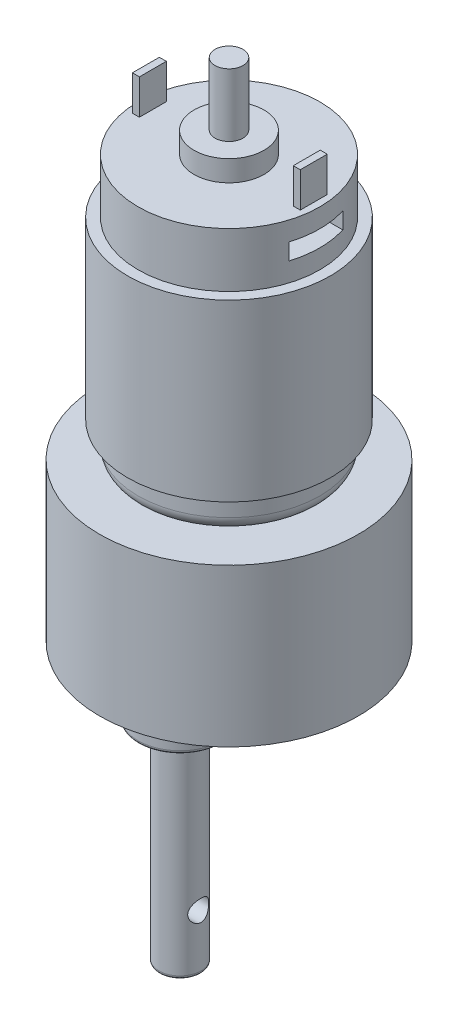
ISO-10303-21;
HEADER;
FILE_DESCRIPTION(('STEP AP214'),'2;1');
FILE_NAME('part.step','',(''),(''),'','','');
FILE_SCHEMA(('AUTOMOTIVE_DESIGN { 1 0 10303 214 1 1 1 1 }'));
ENDSEC;
DATA;
#1=APPLICATION_CONTEXT('core data for automotive mechanical design processes');
#2=APPLICATION_PROTOCOL_DEFINITION('international standard','automotive_design',2000,#1);
#3=PRODUCT_CONTEXT('',#1,'mechanical');
#4=PRODUCT('Part','Part','',(#3));
#5=PRODUCT_RELATED_PRODUCT_CATEGORY('part','',(#4));
#6=PRODUCT_DEFINITION_FORMATION('','',#4);
#7=PRODUCT_DEFINITION_CONTEXT('part definition',#1,'design');
#8=PRODUCT_DEFINITION('design','',#6,#7);
#9=PRODUCT_DEFINITION_SHAPE('','',#8);
#10=(LENGTH_UNIT() NAMED_UNIT(*) SI_UNIT(.MILLI.,.METRE.));
#11=(NAMED_UNIT(*) PLANE_ANGLE_UNIT() SI_UNIT($,.RADIAN.));
#12=(NAMED_UNIT(*) SI_UNIT($,.STERADIAN.) SOLID_ANGLE_UNIT());
#13=UNCERTAINTY_MEASURE_WITH_UNIT(LENGTH_MEASURE(1.E-05),#10,'distance_accuracy_value','');
#14=(GEOMETRIC_REPRESENTATION_CONTEXT(3) GLOBAL_UNCERTAINTY_ASSIGNED_CONTEXT((#13)) GLOBAL_UNIT_ASSIGNED_CONTEXT((#10,
#11,#12)) REPRESENTATION_CONTEXT('',''));
#15=CARTESIAN_POINT('',(0.,0.,0.));
#16=DIRECTION('',(0.,0.,1.));
#17=DIRECTION('',(1.,0.,0.));
#18=AXIS2_PLACEMENT_3D('',#15,#16,#17);
#19=CARTESIAN_POINT('',(-12.,65.3,-2.04396741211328));
#20=DIRECTION('',(0.,0.,1.));
#21=DIRECTION('',(1.,0.,0.));
#22=AXIS2_PLACEMENT_3D('',#19,#20,#21);
#23=PLANE('',#22);
#24=DIRECTION('',(-1.,0.,0.));
#25=VECTOR('',#24,1.);
#26=CARTESIAN_POINT('',(-12.,60.3,-2.04396741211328));
#27=LINE('',#26,#25);
#28=CARTESIAN_POINT('',(-11.,60.3,-2.04396741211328));
#29=VERTEX_POINT('',#28);
#30=CARTESIAN_POINT('',(-12.,60.3,-2.04396741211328));
#31=VERTEX_POINT('',#30);
#32=EDGE_CURVE('E120',#29,#31,#27,.T.);
#33=ORIENTED_EDGE('',*,*,#32,.T.);
#34=DIRECTION('',(0.,-1.,0.));
#35=VECTOR('',#34,1.);
#36=CARTESIAN_POINT('',(-12.,65.3,-2.04396741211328));
#37=LINE('',#36,#35);
#38=CARTESIAN_POINT('',(-12.,65.3,-2.04396741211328));
#39=VERTEX_POINT('',#38);
#40=EDGE_CURVE('E12',#39,#31,#37,.T.);
#41=ORIENTED_EDGE('',*,*,#40,.F.);
#42=DIRECTION('',(-1.,0.,0.));
#43=VECTOR('',#42,1.);
#44=CARTESIAN_POINT('',(-12.,65.3,-2.04396741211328));
#45=LINE('',#44,#43);
#46=CARTESIAN_POINT('',(-11.,65.3,-2.04396741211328));
#47=VERTEX_POINT('',#46);
#48=EDGE_CURVE('E108',#47,#39,#45,.T.);
#49=ORIENTED_EDGE('',*,*,#48,.F.);
#50=DIRECTION('',(0.,-1.,0.));
#51=VECTOR('',#50,1.);
#52=CARTESIAN_POINT('',(-11.,65.3,-2.04396741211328));
#53=LINE('',#52,#51);
#54=EDGE_CURVE('E116',#47,#29,#53,.T.);
#55=ORIENTED_EDGE('',*,*,#54,.T.);
#56=EDGE_LOOP('',(#33,#41,#49,#55));
#57=FACE_BOUND('',#56,.T.);
#58=ADVANCED_FACE('F57',(#57),#23,.F.);
#59=CARTESIAN_POINT('',(-12.,65.3,-2.04396741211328));
#60=DIRECTION('',(1.,0.,0.));
#61=DIRECTION('',(0.,0.,-1.));
#62=AXIS2_PLACEMENT_3D('',#59,#60,#61);
#63=PLANE('',#62);
#64=DIRECTION('',(0.,0.,1.));
#65=VECTOR('',#64,1.);
#66=CARTESIAN_POINT('',(-12.,60.3,-2.04396741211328));
#67=LINE('',#66,#65);
#68=CARTESIAN_POINT('',(-12.,60.3,1.81037113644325));
#69=VERTEX_POINT('',#68);
#70=EDGE_CURVE('E112',#31,#69,#67,.T.);
#71=ORIENTED_EDGE('',*,*,#70,.T.);
#72=DIRECTION('',(0.,-1.,0.));
#73=VECTOR('',#72,1.);
#74=CARTESIAN_POINT('',(-12.,65.3,1.81037113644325));
#75=LINE('',#74,#73);
#76=CARTESIAN_POINT('',(-12.,65.3,1.81037113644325));
#77=VERTEX_POINT('',#76);
#78=EDGE_CURVE('E65',#77,#69,#75,.T.);
#79=ORIENTED_EDGE('',*,*,#78,.F.);
#80=DIRECTION('',(0.,0.,1.));
#81=VECTOR('',#80,1.);
#82=CARTESIAN_POINT('',(-12.,65.3,-2.04396741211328));
#83=LINE('',#82,#81);
#84=EDGE_CURVE('E103',#39,#77,#83,.T.);
#85=ORIENTED_EDGE('',*,*,#84,.F.);
#86=ORIENTED_EDGE('',*,*,#40,.T.);
#87=EDGE_LOOP('',(#71,#79,#85,#86));
#88=FACE_BOUND('',#87,.T.);
#89=ADVANCED_FACE('F111',(#88),#63,.F.);
#90=CARTESIAN_POINT('',(-12.,65.3,1.81037113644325));
#91=DIRECTION('',(0.,0.,-1.));
#92=DIRECTION('',(-1.,0.,0.));
#93=AXIS2_PLACEMENT_3D('',#90,#91,#92);
#94=PLANE('',#93);
#95=DIRECTION('',(1.,0.,0.));
#96=VECTOR('',#95,1.);
#97=CARTESIAN_POINT('',(-12.,60.3,1.81037113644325));
#98=LINE('',#97,#96);
#99=CARTESIAN_POINT('',(-11.,60.3,1.81037113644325));
#100=VERTEX_POINT('',#99);
#101=EDGE_CURVE('E90',#69,#100,#98,.T.);
#102=ORIENTED_EDGE('',*,*,#101,.T.);
#103=DIRECTION('',(0.,-1.,0.));
#104=VECTOR('',#103,1.);
#105=CARTESIAN_POINT('',(-11.,65.3,1.81037113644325));
#106=LINE('',#105,#104);
#107=CARTESIAN_POINT('',(-11.,65.3,1.81037113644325));
#108=VERTEX_POINT('',#107);
#109=EDGE_CURVE('E113',#108,#100,#106,.T.);
#110=ORIENTED_EDGE('',*,*,#109,.F.);
#111=DIRECTION('',(1.,0.,0.));
#112=VECTOR('',#111,1.);
#113=CARTESIAN_POINT('',(-12.,65.3,1.81037113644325));
#114=LINE('',#113,#112);
#115=EDGE_CURVE('E106',#77,#108,#114,.T.);
#116=ORIENTED_EDGE('',*,*,#115,.F.);
#117=ORIENTED_EDGE('',*,*,#78,.T.);
#118=EDGE_LOOP('',(#102,#110,#116,#117));
#119=FACE_BOUND('',#118,.T.);
#120=ADVANCED_FACE('F114',(#119),#94,.F.);
#121=CARTESIAN_POINT('',(-11.,65.3,-2.04396741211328));
#122=DIRECTION('',(-1.,0.,0.));
#123=DIRECTION('',(0.,0.,1.));
#124=AXIS2_PLACEMENT_3D('',#121,#122,#123);
#125=PLANE('',#124);
#126=DIRECTION('',(0.,0.,-1.));
#127=VECTOR('',#126,1.);
#128=CARTESIAN_POINT('',(-11.,60.3,-2.04396741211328));
#129=LINE('',#128,#127);
#130=EDGE_CURVE('E96',#100,#29,#129,.T.);
#131=ORIENTED_EDGE('',*,*,#130,.T.);
#132=ORIENTED_EDGE('',*,*,#54,.F.);
#133=DIRECTION('',(0.,0.,-1.));
#134=VECTOR('',#133,1.);
#135=CARTESIAN_POINT('',(-11.,65.3,-2.04396741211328));
#136=LINE('',#135,#134);
#137=EDGE_CURVE('E73',#108,#47,#136,.T.);
#138=ORIENTED_EDGE('',*,*,#137,.F.);
#139=ORIENTED_EDGE('',*,*,#109,.T.);
#140=EDGE_LOOP('',(#131,#132,#138,#139));
#141=FACE_BOUND('',#140,.T.);
#142=ADVANCED_FACE('F127',(#141),#125,.F.);
#143=CARTESIAN_POINT('',(0.,65.3,0.));
#144=DIRECTION('',(0.,-1.,0.));
#145=DIRECTION('',(0.,0.,-1.));
#146=AXIS2_PLACEMENT_3D('',#143,#144,#145);
#147=PLANE('',#146);
#148=ORIENTED_EDGE('',*,*,#48,.T.);
#149=ORIENTED_EDGE('',*,*,#84,.T.);
#150=ORIENTED_EDGE('',*,*,#115,.T.);
#151=ORIENTED_EDGE('',*,*,#137,.T.);
#152=EDGE_LOOP('',(#148,#149,#150,#151));
#153=FACE_BOUND('',#152,.T.);
#154=ADVANCED_FACE('F104',(#153),#147,.F.);
#155=CARTESIAN_POINT('',(0.,60.3,0.));
#156=DIRECTION('',(0.,-1.,0.));
#157=DIRECTION('',(0.,0.,-1.));
#158=AXIS2_PLACEMENT_3D('',#155,#156,#157);
#159=PLANE('',#158);
#160=ORIENTED_EDGE('',*,*,#32,.F.);
#161=ORIENTED_EDGE('',*,*,#130,.F.);
#162=ORIENTED_EDGE('',*,*,#101,.F.);
#163=ORIENTED_EDGE('',*,*,#70,.F.);
#164=EDGE_LOOP('',(#160,#161,#162,#163));
#165=FACE_BOUND('',#164,.T.);
#166=ADVANCED_FACE('F130',(#165),#159,.T.);
#167=CLOSED_SHELL('',(#58,#89,#120,#142,#154,#166));
#168=MANIFOLD_SOLID_BREP('B2',#167);
#169=CARTESIAN_POINT('',(12.,65.3,-2.04396741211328));
#170=DIRECTION('',(-1.,0.,0.));
#171=DIRECTION('',(0.,0.,1.));
#172=AXIS2_PLACEMENT_3D('',#169,#170,#171);
#173=PLANE('',#172);
#174=DIRECTION('',(0.,0.,-1.));
#175=VECTOR('',#174,1.);
#176=CARTESIAN_POINT('',(12.,60.3,-2.04396741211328));
#177=LINE('',#176,#175);
#178=CARTESIAN_POINT('',(12.,60.3,1.81037113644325));
#179=VERTEX_POINT('',#178);
#180=CARTESIAN_POINT('',(12.,60.3,-2.04396741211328));
#181=VERTEX_POINT('',#180);
#182=EDGE_CURVE('E263',#179,#181,#177,.T.);
#183=ORIENTED_EDGE('',*,*,#182,.T.);
#184=DIRECTION('',(0.,-1.,0.));
#185=VECTOR('',#184,1.);
#186=CARTESIAN_POINT('',(12.,65.3,-2.04396741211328));
#187=LINE('',#186,#185);
#188=CARTESIAN_POINT('',(12.,65.3,-2.04396741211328));
#189=VERTEX_POINT('',#188);
#190=EDGE_CURVE('E55',#189,#181,#187,.T.);
#191=ORIENTED_EDGE('',*,*,#190,.F.);
#192=DIRECTION('',(0.,0.,-1.));
#193=VECTOR('',#192,1.);
#194=CARTESIAN_POINT('',(12.,65.3,-2.04396741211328));
#195=LINE('',#194,#193);
#196=CARTESIAN_POINT('',(12.,65.3,1.81037113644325));
#197=VERTEX_POINT('',#196);
#198=EDGE_CURVE('E251',#197,#189,#195,.T.);
#199=ORIENTED_EDGE('',*,*,#198,.F.);
#200=DIRECTION('',(0.,-1.,0.));
#201=VECTOR('',#200,1.);
#202=CARTESIAN_POINT('',(12.,65.3,1.81037113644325));
#203=LINE('',#202,#201);
#204=EDGE_CURVE('E259',#197,#179,#203,.T.);
#205=ORIENTED_EDGE('',*,*,#204,.T.);
#206=EDGE_LOOP('',(#183,#191,#199,#205));
#207=FACE_BOUND('',#206,.T.);
#208=ADVANCED_FACE('F200',(#207),#173,.F.);
#209=CARTESIAN_POINT('',(12.,65.3,-2.04396741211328));
#210=DIRECTION('',(0.,0.,1.));
#211=DIRECTION('',(1.,0.,0.));
#212=AXIS2_PLACEMENT_3D('',#209,#210,#211);
#213=PLANE('',#212);
#214=DIRECTION('',(-1.,0.,0.));
#215=VECTOR('',#214,1.);
#216=CARTESIAN_POINT('',(12.,60.3,-2.04396741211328));
#217=LINE('',#216,#215);
#218=CARTESIAN_POINT('',(11.,60.3,-2.04396741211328));
#219=VERTEX_POINT('',#218);
#220=EDGE_CURVE('E255',#181,#219,#217,.T.);
#221=ORIENTED_EDGE('',*,*,#220,.T.);
#222=DIRECTION('',(0.,-1.,0.));
#223=VECTOR('',#222,1.);
#224=CARTESIAN_POINT('',(11.,65.3,-2.04396741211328));
#225=LINE('',#224,#223);
#226=CARTESIAN_POINT('',(11.,65.3,-2.04396741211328));
#227=VERTEX_POINT('',#226);
#228=EDGE_CURVE('E208',#227,#219,#225,.T.);
#229=ORIENTED_EDGE('',*,*,#228,.F.);
#230=DIRECTION('',(-1.,0.,0.));
#231=VECTOR('',#230,1.);
#232=CARTESIAN_POINT('',(12.,65.3,-2.04396741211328));
#233=LINE('',#232,#231);
#234=EDGE_CURVE('E246',#189,#227,#233,.T.);
#235=ORIENTED_EDGE('',*,*,#234,.F.);
#236=ORIENTED_EDGE('',*,*,#190,.T.);
#237=EDGE_LOOP('',(#221,#229,#235,#236));
#238=FACE_BOUND('',#237,.T.);
#239=ADVANCED_FACE('F254',(#238),#213,.F.);
#240=CARTESIAN_POINT('',(11.,65.3,-2.04396741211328));
#241=DIRECTION('',(1.,0.,0.));
#242=DIRECTION('',(0.,0.,-1.));
#243=AXIS2_PLACEMENT_3D('',#240,#241,#242);
#244=PLANE('',#243);
#245=DIRECTION('',(0.,0.,1.));
#246=VECTOR('',#245,1.);
#247=CARTESIAN_POINT('',(11.,60.3,-2.04396741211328));
#248=LINE('',#247,#246);
#249=CARTESIAN_POINT('',(11.,60.3,1.81037113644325));
#250=VERTEX_POINT('',#249);
#251=EDGE_CURVE('E233',#219,#250,#248,.T.);
#252=ORIENTED_EDGE('',*,*,#251,.T.);
#253=DIRECTION('',(0.,-1.,0.));
#254=VECTOR('',#253,1.);
#255=CARTESIAN_POINT('',(11.,65.3,1.81037113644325));
#256=LINE('',#255,#254);
#257=CARTESIAN_POINT('',(11.,65.3,1.81037113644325));
#258=VERTEX_POINT('',#257);
#259=EDGE_CURVE('E256',#258,#250,#256,.T.);
#260=ORIENTED_EDGE('',*,*,#259,.F.);
#261=DIRECTION('',(0.,0.,1.));
#262=VECTOR('',#261,1.);
#263=CARTESIAN_POINT('',(11.,65.3,-2.04396741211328));
#264=LINE('',#263,#262);
#265=EDGE_CURVE('E249',#227,#258,#264,.T.);
#266=ORIENTED_EDGE('',*,*,#265,.F.);
#267=ORIENTED_EDGE('',*,*,#228,.T.);
#268=EDGE_LOOP('',(#252,#260,#266,#267));
#269=FACE_BOUND('',#268,.T.);
#270=ADVANCED_FACE('F257',(#269),#244,.F.);
#271=CARTESIAN_POINT('',(12.,65.3,1.81037113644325));
#272=DIRECTION('',(0.,0.,-1.));
#273=DIRECTION('',(-1.,0.,0.));
#274=AXIS2_PLACEMENT_3D('',#271,#272,#273);
#275=PLANE('',#274);
#276=DIRECTION('',(1.,0.,0.));
#277=VECTOR('',#276,1.);
#278=CARTESIAN_POINT('',(12.,60.3,1.81037113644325));
#279=LINE('',#278,#277);
#280=EDGE_CURVE('E239',#250,#179,#279,.T.);
#281=ORIENTED_EDGE('',*,*,#280,.T.);
#282=ORIENTED_EDGE('',*,*,#204,.F.);
#283=DIRECTION('',(1.,0.,0.));
#284=VECTOR('',#283,1.);
#285=CARTESIAN_POINT('',(12.,65.3,1.81037113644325));
#286=LINE('',#285,#284);
#287=EDGE_CURVE('E216',#258,#197,#286,.T.);
#288=ORIENTED_EDGE('',*,*,#287,.F.);
#289=ORIENTED_EDGE('',*,*,#259,.T.);
#290=EDGE_LOOP('',(#281,#282,#288,#289));
#291=FACE_BOUND('',#290,.T.);
#292=ADVANCED_FACE('F270',(#291),#275,.F.);
#293=CARTESIAN_POINT('',(0.,65.3,0.));
#294=DIRECTION('',(0.,-1.,0.));
#295=DIRECTION('',(0.,0.,-1.));
#296=AXIS2_PLACEMENT_3D('',#293,#294,#295);
#297=PLANE('',#296);
#298=ORIENTED_EDGE('',*,*,#198,.T.);
#299=ORIENTED_EDGE('',*,*,#234,.T.);
#300=ORIENTED_EDGE('',*,*,#265,.T.);
#301=ORIENTED_EDGE('',*,*,#287,.T.);
#302=EDGE_LOOP('',(#298,#299,#300,#301));
#303=FACE_BOUND('',#302,.T.);
#304=ADVANCED_FACE('F247',(#303),#297,.F.);
#305=CARTESIAN_POINT('',(0.,60.3,0.));
#306=DIRECTION('',(0.,-1.,0.));
#307=DIRECTION('',(0.,0.,-1.));
#308=AXIS2_PLACEMENT_3D('',#305,#306,#307);
#309=PLANE('',#308);
#310=ORIENTED_EDGE('',*,*,#182,.F.);
#311=ORIENTED_EDGE('',*,*,#280,.F.);
#312=ORIENTED_EDGE('',*,*,#251,.F.);
#313=ORIENTED_EDGE('',*,*,#220,.F.);
#314=EDGE_LOOP('',(#310,#311,#312,#313));
#315=FACE_BOUND('',#314,.T.);
#316=ADVANCED_FACE('F273',(#315),#309,.T.);
#317=CLOSED_SHELL('',(#208,#239,#270,#292,#304,#316));
#318=MANIFOLD_SOLID_BREP('B6',#317);
#319=CARTESIAN_POINT('',(0.,-36.3,7.));
#320=DIRECTION('',(0.,1.,0.));
#321=DIRECTION('',(0.,0.,1.));
#322=AXIS2_PLACEMENT_3D('',#319,#320,#321);
#323=CYLINDRICAL_SURFACE('',#322,3.);
#324=CARTESIAN_POINT('',(0.,-35.8,7.));
#325=DIRECTION('',(0.,-1.,0.));
#326=DIRECTION('',(0.,0.,-1.));
#327=AXIS2_PLACEMENT_3D('',#324,#325,#326);
#328=CIRCLE('',#327,3.);
#329=CARTESIAN_POINT('',(0.,-35.8,4.));
#330=VERTEX_POINT('',#329);
#331=EDGE_CURVE('E199',#330,#330,#328,.F.);
#332=ORIENTED_EDGE('',*,*,#331,.T.);
#333=EDGE_LOOP('',(#332));
#334=FACE_BOUND('',#333,.T.);
#335=CARTESIAN_POINT('',(0.,-6.3,7.));
#336=DIRECTION('',(0.,-1.,0.));
#337=DIRECTION('',(0.,0.,-1.));
#338=AXIS2_PLACEMENT_3D('',#335,#336,#337);
#339=CIRCLE('',#338,3.);
#340=CARTESIAN_POINT('',(0.,-6.3,4.));
#341=VERTEX_POINT('',#340);
#342=EDGE_CURVE('E362',#341,#341,#339,.T.);
#343=ORIENTED_EDGE('',*,*,#342,.T.);
#344=EDGE_LOOP('',(#343));
#345=FACE_BOUND('',#344,.T.);
#346=CARTESIAN_POINT('',(-2.59807621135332,-28.3,8.5));
#347=CARTESIAN_POINT('',(-2.59808302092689,-28.2218382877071,8.4999945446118));
#348=CARTESIAN_POINT('',(-2.60165701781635,-28.1435778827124,8.49384995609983));
#349=CARTESIAN_POINT('',(-2.61543549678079,-27.9894591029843,8.46958481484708));
#350=CARTESIAN_POINT('',(-2.62565391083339,-27.9136061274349,8.45143909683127));
#351=CARTESIAN_POINT('',(-2.65124019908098,-27.7668225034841,8.40414992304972));
#352=CARTESIAN_POINT('',(-2.66658065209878,-27.6958680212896,8.3750649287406));
#353=CARTESIAN_POINT('',(-2.70063997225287,-27.5598636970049,8.30690128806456));
#354=CARTESIAN_POINT('',(-2.71935902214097,-27.4948141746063,8.26782210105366));
#355=CARTESIAN_POINT('',(-2.75995303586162,-27.3665414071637,8.17699981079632));
#356=CARTESIAN_POINT('',(-2.7819609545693,-27.3039112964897,8.12447805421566));
#357=CARTESIAN_POINT('',(-2.82557974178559,-27.1878874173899,8.0098807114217));
#358=CARTESIAN_POINT('',(-2.84719040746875,-27.1344982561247,7.94780038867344));
#359=CARTESIAN_POINT('',(-2.88932215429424,-27.0349492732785,7.81073434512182));
#360=CARTESIAN_POINT('',(-2.90967159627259,-26.9895193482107,7.73516078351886));
#361=CARTESIAN_POINT('',(-2.94526134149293,-26.9122887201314,7.57623553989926));
#362=CARTESIAN_POINT('',(-2.96050486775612,-26.8804794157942,7.49288880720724));
#363=CARTESIAN_POINT('',(-2.98320691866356,-26.8337430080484,7.32706741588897));
#364=CARTESIAN_POINT('',(-2.99114220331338,-26.8177757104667,7.24495268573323));
#365=CARTESIAN_POINT('',(-3.000113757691,-26.7997508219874,7.07885594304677));
#366=CARTESIAN_POINT('',(-3.00115420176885,-26.7976848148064,6.99487509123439));
#367=CARTESIAN_POINT('',(-2.99644472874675,-26.8071200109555,6.83525121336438));
#368=CARTESIAN_POINT('',(-2.99127743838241,-26.8174570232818,6.75951820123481));
#369=CARTESIAN_POINT('',(-2.97561367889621,-26.849321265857,6.61102934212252));
#370=CARTESIAN_POINT('',(-2.96511681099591,-26.8708493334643,6.53827371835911));
#371=CARTESIAN_POINT('',(-2.93957374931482,-26.9246238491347,6.39653591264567));
#372=CARTESIAN_POINT('',(-2.92446662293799,-26.9570144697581,6.32761986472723));
#373=CARTESIAN_POINT('',(-2.89106468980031,-27.0313951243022,6.19603479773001));
#374=CARTESIAN_POINT('',(-2.87276874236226,-27.0733885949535,6.13336802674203));
#375=CARTESIAN_POINT('',(-2.83266591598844,-27.1703430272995,6.00973950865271));
#376=CARTESIAN_POINT('',(-2.81069063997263,-27.226154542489,5.94949888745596));
#377=CARTESIAN_POINT('',(-2.76681510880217,-27.3468845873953,5.83884344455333));
#378=CARTESIAN_POINT('',(-2.74491492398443,-27.4118100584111,5.78843618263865));
#379=CARTESIAN_POINT('',(-2.70216234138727,-27.5539722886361,5.69574199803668));
#380=CARTESIAN_POINT('',(-2.68146479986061,-27.6317290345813,5.65417402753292));
#381=CARTESIAN_POINT('',(-2.64563175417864,-27.7944065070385,5.58502133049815));
#382=CARTESIAN_POINT('',(-2.63049045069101,-27.8793196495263,5.55742201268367));
#383=CARTESIAN_POINT('',(-2.60916953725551,-28.0468217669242,5.51922968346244));
#384=CARTESIAN_POINT('',(-2.60237483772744,-28.1290616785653,5.50746231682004));
#385=CARTESIAN_POINT('',(-2.59676879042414,-28.2946020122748,5.49772458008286));
#386=CARTESIAN_POINT('',(-2.59795180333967,-28.3779016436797,5.49974446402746));
#387=CARTESIAN_POINT('',(-2.60751504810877,-28.5334808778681,5.51644593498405));
#388=CARTESIAN_POINT('',(-2.61509381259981,-28.6059691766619,5.5297182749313));
#389=CARTESIAN_POINT('',(-2.63541032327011,-28.7475516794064,5.56645557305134));
#390=CARTESIAN_POINT('',(-2.64814974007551,-28.8166447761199,5.58992383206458));
#391=CARTESIAN_POINT('',(-2.67804333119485,-28.953116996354,5.64752861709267));
#392=CARTESIAN_POINT('',(-2.69537464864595,-29.0202685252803,5.68210890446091));
#393=CARTESIAN_POINT('',(-2.73234179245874,-29.1482039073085,5.76056940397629));
#394=CARTESIAN_POINT('',(-2.75197880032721,-29.2089844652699,5.80445439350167));
#395=CARTESIAN_POINT('',(-2.79431997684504,-29.3304681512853,5.90674424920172));
#396=CARTESIAN_POINT('',(-2.81709874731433,-29.3901957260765,5.96628209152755));
#397=CARTESIAN_POINT('',(-2.86101352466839,-29.4991183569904,6.09489325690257));
#398=CARTESIAN_POINT('',(-2.88214897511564,-29.5483098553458,6.16396978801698));
#399=CARTESIAN_POINT('',(-2.92112042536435,-29.6358605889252,6.31219695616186));
#400=CARTESIAN_POINT('',(-2.93885462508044,-29.6738996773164,6.39156535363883));
#401=CARTESIAN_POINT('',(-2.96825032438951,-29.7357068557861,6.55671645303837));
#402=CARTESIAN_POINT('',(-2.97991715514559,-29.7594874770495,6.64249344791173));
#403=CARTESIAN_POINT('',(-2.99501262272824,-29.790052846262,6.80953047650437));
#404=CARTESIAN_POINT('',(-2.99909891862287,-29.7981968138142,6.89048283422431));
#405=CARTESIAN_POINT('',(-3.00063195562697,-29.8012648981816,7.0526889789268));
#406=CARTESIAN_POINT('',(-2.99808102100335,-29.7961936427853,7.13394265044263));
#407=CARTESIAN_POINT('',(-2.98700953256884,-29.7738753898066,7.28880698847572));
#408=CARTESIAN_POINT('',(-2.97889342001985,-29.7574527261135,7.36256847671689));
#409=CARTESIAN_POINT('',(-2.95788140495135,-29.7140095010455,7.50616892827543));
#410=CARTESIAN_POINT('',(-2.94498481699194,-29.6869874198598,7.57600732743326));
#411=CARTESIAN_POINT('',(-2.9148889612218,-29.621909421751,7.71313510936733));
#412=CARTESIAN_POINT('',(-2.89752925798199,-29.5834310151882,7.78018771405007));
#413=CARTESIAN_POINT('',(-2.86032199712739,-29.4970631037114,7.90716196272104));
#414=CARTESIAN_POINT('',(-2.84047329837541,-29.4491692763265,7.96708031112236));
#415=CARTESIAN_POINT('',(-2.79792915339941,-29.3398042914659,8.08437100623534));
#416=CARTESIAN_POINT('',(-2.77514698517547,-29.2774562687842,8.14089652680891));
#417=CARTESIAN_POINT('',(-2.73094614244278,-29.1438239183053,8.24299493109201));
#418=CARTESIAN_POINT('',(-2.70952868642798,-29.0725317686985,8.28855812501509));
#419=CARTESIAN_POINT('',(-2.66999407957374,-28.9200450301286,8.36864661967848));
#420=CARTESIAN_POINT('',(-2.65200261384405,-28.8386087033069,8.40277759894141));
#421=CARTESIAN_POINT('',(-2.62299234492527,-28.6700013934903,8.45631806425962));
#422=CARTESIAN_POINT('',(-2.61195024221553,-28.582850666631,8.47577678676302));
#423=CARTESIAN_POINT('',(-2.60293908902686,-28.462291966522,8.49155051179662));
#424=CARTESIAN_POINT('',(-2.60112193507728,-28.4299481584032,8.49471415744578));
#425=CARTESIAN_POINT('',(-2.59868903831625,-28.3650752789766,8.49894010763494));
#426=CARTESIAN_POINT('',(-2.59807337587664,-28.3325461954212,8.50000227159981));
#427=CARTESIAN_POINT('',(-2.59807621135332,-28.3,8.5));
#428=B_SPLINE_CURVE_WITH_KNOTS('',3,(#346,#347,#348,#349,#350,#351,#352,#353,#354,#355,#356,
#357,#358,#359,#360,#361,#362,#363,#364,#365,#366,#367,#368,#369,#370,#371,#372,#373,#374,#375,
#376,#377,#378,#379,#380,#381,#382,#383,#384,#385,#386,#387,#388,#389,#390,#391,#392,#393,#394,
#395,#396,#397,#398,#399,#400,#401,#402,#403,#404,#405,#406,#407,#408,#409,#410,#411,#412,#413,
#414,#415,#416,#417,#418,#419,#420,#421,#422,#423,#424,#425,#426,#427),.UNSPECIFIED.,.T.,.F.,(4,
2,2,2,2,2,2,2,2,2,2,2,2,2,2,2,2,2,2,2,2,2,2,2,2,2,2,2,2,2,2,2,2,2,2,2,2,2,2,2,4),(0.,
0.234348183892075,0.469189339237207,0.702792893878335,0.936409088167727,1.18929346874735,
1.44230356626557,1.71236838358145,1.98226240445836,2.23295227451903,2.4834903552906,
2.71224146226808,2.94100968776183,3.1729430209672,3.40495949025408,3.65890787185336,
3.91305072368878,4.18333262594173,4.45333161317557,4.70193436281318,4.9503613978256,
5.17161275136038,5.39293578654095,5.62450944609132,5.85620229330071,6.1171011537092,
6.37808797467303,6.64596272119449,6.91360169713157,7.15668405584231,7.39968130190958,
7.62666637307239,7.8536840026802,8.09041126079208,8.32724745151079,8.58765362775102,
8.84828914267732,9.11716123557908,9.38512699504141,9.48270202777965,9.58028358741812),.UNSPECIFIED.);
#429=CARTESIAN_POINT('',(-2.59807621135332,-28.3,8.5));
#430=VERTEX_POINT('',#429);
#431=EDGE_CURVE('E365',#430,#430,#428,.T.);
#432=ORIENTED_EDGE('',*,*,#431,.F.);
#433=EDGE_LOOP('',(#432));
#434=FACE_BOUND('',#433,.T.);
#435=CARTESIAN_POINT('',(2.59807621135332,-28.3,8.5));
#436=CARTESIAN_POINT('',(2.59808302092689,-28.3781617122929,8.4999945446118));
#437=CARTESIAN_POINT('',(2.60165701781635,-28.4564221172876,8.49384995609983));
#438=CARTESIAN_POINT('',(2.61543549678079,-28.6105408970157,8.46958481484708));
#439=CARTESIAN_POINT('',(2.62565391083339,-28.6863938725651,8.45143909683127));
#440=CARTESIAN_POINT('',(2.65124019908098,-28.8331774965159,8.40414992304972));
#441=CARTESIAN_POINT('',(2.66658065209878,-28.9041319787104,8.3750649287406));
#442=CARTESIAN_POINT('',(2.70063997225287,-29.0401363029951,8.30690128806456));
#443=CARTESIAN_POINT('',(2.71935902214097,-29.1051858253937,8.26782210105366));
#444=CARTESIAN_POINT('',(2.75995303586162,-29.2334585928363,8.17699981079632));
#445=CARTESIAN_POINT('',(2.7819609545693,-29.2960887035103,8.12447805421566));
#446=CARTESIAN_POINT('',(2.82557974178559,-29.4121125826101,8.0098807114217));
#447=CARTESIAN_POINT('',(2.84719040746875,-29.4655017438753,7.94780038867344));
#448=CARTESIAN_POINT('',(2.88932215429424,-29.5650507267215,7.81073434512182));
#449=CARTESIAN_POINT('',(2.90967159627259,-29.6104806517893,7.73516078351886));
#450=CARTESIAN_POINT('',(2.94526134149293,-29.6877112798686,7.57623553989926));
#451=CARTESIAN_POINT('',(2.96050486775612,-29.7195205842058,7.49288880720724));
#452=CARTESIAN_POINT('',(2.98320691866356,-29.7662569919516,7.32706741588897));
#453=CARTESIAN_POINT('',(2.99114220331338,-29.7822242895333,7.24495268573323));
#454=CARTESIAN_POINT('',(3.000113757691,-29.8002491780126,7.07885594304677));
#455=CARTESIAN_POINT('',(3.00115420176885,-29.8023151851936,6.99487509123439));
#456=CARTESIAN_POINT('',(2.99644472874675,-29.7928799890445,6.83525121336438));
#457=CARTESIAN_POINT('',(2.99127743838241,-29.7825429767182,6.75951820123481));
#458=CARTESIAN_POINT('',(2.97561367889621,-29.750678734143,6.61102934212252));
#459=CARTESIAN_POINT('',(2.96511681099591,-29.7291506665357,6.53827371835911));
#460=CARTESIAN_POINT('',(2.93957374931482,-29.6753761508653,6.39653591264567));
#461=CARTESIAN_POINT('',(2.92446662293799,-29.6429855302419,6.32761986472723));
#462=CARTESIAN_POINT('',(2.89106468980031,-29.5686048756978,6.19603479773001));
#463=CARTESIAN_POINT('',(2.87276874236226,-29.5266114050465,6.13336802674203));
#464=CARTESIAN_POINT('',(2.83266591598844,-29.4296569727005,6.00973950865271));
#465=CARTESIAN_POINT('',(2.81069063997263,-29.373845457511,5.94949888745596));
#466=CARTESIAN_POINT('',(2.76681510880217,-29.2531154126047,5.83884344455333));
#467=CARTESIAN_POINT('',(2.74491492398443,-29.1881899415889,5.78843618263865));
#468=CARTESIAN_POINT('',(2.70216234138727,-29.0460277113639,5.69574199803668));
#469=CARTESIAN_POINT('',(2.68146479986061,-28.9682709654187,5.65417402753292));
#470=CARTESIAN_POINT('',(2.64563175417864,-28.8055934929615,5.58502133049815));
#471=CARTESIAN_POINT('',(2.63049045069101,-28.7206803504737,5.55742201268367));
#472=CARTESIAN_POINT('',(2.60916953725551,-28.5531782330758,5.51922968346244));
#473=CARTESIAN_POINT('',(2.60237483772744,-28.4709383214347,5.50746231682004));
#474=CARTESIAN_POINT('',(2.59676879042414,-28.3053979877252,5.49772458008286));
#475=CARTESIAN_POINT('',(2.59795180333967,-28.2220983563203,5.49974446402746));
#476=CARTESIAN_POINT('',(2.60751504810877,-28.0665191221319,5.51644593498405));
#477=CARTESIAN_POINT('',(2.61509381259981,-27.9940308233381,5.5297182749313));
#478=CARTESIAN_POINT('',(2.63541032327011,-27.8524483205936,5.56645557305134));
#479=CARTESIAN_POINT('',(2.64814974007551,-27.7833552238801,5.58992383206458));
#480=CARTESIAN_POINT('',(2.67804333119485,-27.646883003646,5.64752861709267));
#481=CARTESIAN_POINT('',(2.69537464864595,-27.5797314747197,5.68210890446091));
#482=CARTESIAN_POINT('',(2.73234179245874,-27.4517960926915,5.76056940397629));
#483=CARTESIAN_POINT('',(2.75197880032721,-27.3910155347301,5.80445439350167));
#484=CARTESIAN_POINT('',(2.79431997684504,-27.2695318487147,5.90674424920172));
#485=CARTESIAN_POINT('',(2.81709874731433,-27.2098042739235,5.96628209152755));
#486=CARTESIAN_POINT('',(2.86101352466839,-27.1008816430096,6.09489325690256));
#487=CARTESIAN_POINT('',(2.88214897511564,-27.0516901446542,6.16396978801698));
#488=CARTESIAN_POINT('',(2.92112042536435,-26.9641394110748,6.31219695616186));
#489=CARTESIAN_POINT('',(2.93885462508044,-26.9261003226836,6.39156535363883));
#490=CARTESIAN_POINT('',(2.96825032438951,-26.8642931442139,6.55671645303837));
#491=CARTESIAN_POINT('',(2.97991715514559,-26.8405125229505,6.64249344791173));
#492=CARTESIAN_POINT('',(2.99501262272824,-26.809947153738,6.80953047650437));
#493=CARTESIAN_POINT('',(2.99909891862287,-26.8018031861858,6.89048283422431));
#494=CARTESIAN_POINT('',(3.00063195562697,-26.7987351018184,7.0526889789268));
#495=CARTESIAN_POINT('',(2.99808102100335,-26.8038063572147,7.13394265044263));
#496=CARTESIAN_POINT('',(2.98700953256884,-26.8261246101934,7.28880698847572));
#497=CARTESIAN_POINT('',(2.97889342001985,-26.8425472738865,7.36256847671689));
#498=CARTESIAN_POINT('',(2.95788140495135,-26.8859904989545,7.50616892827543));
#499=CARTESIAN_POINT('',(2.94498481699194,-26.9130125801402,7.57600732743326));
#500=CARTESIAN_POINT('',(2.9148889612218,-26.978090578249,7.71313510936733));
#501=CARTESIAN_POINT('',(2.89752925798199,-27.0165689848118,7.78018771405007));
#502=CARTESIAN_POINT('',(2.86032199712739,-27.1029368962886,7.90716196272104));
#503=CARTESIAN_POINT('',(2.84047329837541,-27.1508307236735,7.96708031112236));
#504=CARTESIAN_POINT('',(2.79792915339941,-27.2601957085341,8.08437100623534));
#505=CARTESIAN_POINT('',(2.77514698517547,-27.3225437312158,8.14089652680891));
#506=CARTESIAN_POINT('',(2.73094614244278,-27.4561760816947,8.24299493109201));
#507=CARTESIAN_POINT('',(2.70952868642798,-27.5274682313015,8.28855812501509));
#508=CARTESIAN_POINT('',(2.66999407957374,-27.6799549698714,8.36864661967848));
#509=CARTESIAN_POINT('',(2.65200261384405,-27.7613912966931,8.40277759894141));
#510=CARTESIAN_POINT('',(2.62299234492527,-27.9299986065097,8.45631806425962));
#511=CARTESIAN_POINT('',(2.61195024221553,-28.017149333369,8.47577678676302));
#512=CARTESIAN_POINT('',(2.60293908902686,-28.137708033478,8.49155051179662));
#513=CARTESIAN_POINT('',(2.60112193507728,-28.1700518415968,8.49471415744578));
#514=CARTESIAN_POINT('',(2.59868903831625,-28.2349247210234,8.49894010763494));
#515=CARTESIAN_POINT('',(2.59807337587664,-28.2674538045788,8.50000227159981));
#516=CARTESIAN_POINT('',(2.59807621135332,-28.3,8.5));
#517=B_SPLINE_CURVE_WITH_KNOTS('',3,(#435,#436,#437,#438,#439,#440,#441,#442,#443,#444,#445,
#446,#447,#448,#449,#450,#451,#452,#453,#454,#455,#456,#457,#458,#459,#460,#461,#462,#463,#464,
#465,#466,#467,#468,#469,#470,#471,#472,#473,#474,#475,#476,#477,#478,#479,#480,#481,#482,#483,
#484,#485,#486,#487,#488,#489,#490,#491,#492,#493,#494,#495,#496,#497,#498,#499,#500,#501,#502,
#503,#504,#505,#506,#507,#508,#509,#510,#511,#512,#513,#514,#515,#516),.UNSPECIFIED.,.T.,.F.,(4,
2,2,2,2,2,2,2,2,2,2,2,2,2,2,2,2,2,2,2,2,2,2,2,2,2,2,2,2,2,2,2,2,2,2,2,2,2,2,2,4),(0.,
0.234348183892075,0.469189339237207,0.702792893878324,0.936409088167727,1.18929346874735,
1.44230356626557,1.71236838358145,1.98226240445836,2.23295227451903,2.4834903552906,
2.71224146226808,2.94100968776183,3.1729430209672,3.40495949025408,3.65890787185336,
3.91305072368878,4.18333262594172,4.45333161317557,4.70193436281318,4.9503613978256,
5.17161275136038,5.39293578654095,5.62450944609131,5.85620229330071,6.1171011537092,
6.37808797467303,6.64596272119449,6.91360169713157,7.1566840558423,7.39968130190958,
7.62666637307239,7.8536840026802,8.09041126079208,8.32724745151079,8.58765362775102,
8.84828914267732,9.11716123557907,9.38512699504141,9.48270202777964,9.58028358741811),.UNSPECIFIED.);
#518=CARTESIAN_POINT('',(2.59807621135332,-28.3,8.5));
#519=VERTEX_POINT('',#518);
#520=EDGE_CURVE('E349',#519,#519,#517,.T.);
#521=ORIENTED_EDGE('',*,*,#520,.F.);
#522=EDGE_LOOP('',(#521));
#523=FACE_BOUND('',#522,.T.);
#524=ADVANCED_FACE('F345',(#334,#345,#434,#523),#323,.T.);
#525=CARTESIAN_POINT('',(0.,-36.3,7.));
#526=DIRECTION('',(0.,-1.,0.));
#527=DIRECTION('',(0.,0.,-1.));
#528=AXIS2_PLACEMENT_3D('',#525,#526,#527);
#529=PLANE('',#528);
#530=CARTESIAN_POINT('',(0.,-36.3,7.));
#531=DIRECTION('',(0.,-1.,0.));
#532=DIRECTION('',(0.,0.,-1.));
#533=AXIS2_PLACEMENT_3D('',#530,#531,#532);
#534=CIRCLE('',#533,2.5);
#535=CARTESIAN_POINT('',(0.,-36.3,4.5));
#536=VERTEX_POINT('',#535);
#537=EDGE_CURVE('E357',#536,#536,#534,.T.);
#538=ORIENTED_EDGE('',*,*,#537,.T.);
#539=EDGE_LOOP('',(#538));
#540=FACE_BOUND('',#539,.T.);
#541=ADVANCED_FACE('F377',(#540),#529,.T.);
#542=CARTESIAN_POINT('',(0.,-6.3,7.));
#543=DIRECTION('',(0.,-1.,0.));
#544=DIRECTION('',(0.,0.,-1.));
#545=AXIS2_PLACEMENT_3D('',#542,#543,#544);
#546=PLANE('',#545);
#547=ORIENTED_EDGE('',*,*,#342,.F.);
#548=EDGE_LOOP('',(#547));
#549=FACE_BOUND('',#548,.T.);
#550=ADVANCED_FACE('F380',(#549),#546,.F.);
#551=CARTESIAN_POINT('',(0.,-35.8,7.));
#552=DIRECTION('',(0.,-1.,0.));
#553=DIRECTION('',(0.,0.,-1.));
#554=AXIS2_PLACEMENT_3D('',#551,#552,#553);
#555=TOROIDAL_SURFACE('',#554,2.5,0.5);
#556=ORIENTED_EDGE('',*,*,#331,.F.);
#557=EDGE_LOOP('',(#556));
#558=FACE_BOUND('',#557,.T.);
#559=ORIENTED_EDGE('',*,*,#537,.F.);
#560=EDGE_LOOP('',(#559));
#561=FACE_BOUND('',#560,.T.);
#562=ADVANCED_FACE('F347',(#558,#561),#555,.T.);
#563=CARTESIAN_POINT('',(30.,-28.3,7.));
#564=DIRECTION('',(-1.,0.,0.));
#565=DIRECTION('',(0.,0.,1.));
#566=AXIS2_PLACEMENT_3D('',#563,#564,#565);
#567=CYLINDRICAL_SURFACE('',#566,1.5);
#568=ORIENTED_EDGE('',*,*,#431,.T.);
#569=EDGE_LOOP('',(#568));
#570=FACE_BOUND('',#569,.T.);
#571=ORIENTED_EDGE('',*,*,#520,.T.);
#572=EDGE_LOOP('',(#571));
#573=FACE_BOUND('',#572,.T.);
#574=ADVANCED_FACE('F372',(#570,#573),#567,.F.);
#575=CLOSED_SHELL('',(#524,#541,#550,#562,#574));
#576=MANIFOLD_SOLID_BREP('B49',#575);
#577=CARTESIAN_POINT('',(0.,60.3,0.));
#578=DIRECTION('',(0.,-1.,0.));
#579=DIRECTION('',(0.,0.,-1.));
#580=AXIS2_PLACEMENT_3D('',#577,#578,#579);
#581=CYLINDRICAL_SURFACE('',#580,13.);
#582=DIRECTION('',(0.,-1.,0.));
#583=VECTOR('',#582,1.);
#584=CARTESIAN_POINT('',(-12.4150154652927,60.3,-3.85582559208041));
#585=LINE('',#584,#583);
#586=CARTESIAN_POINT('',(-12.4150154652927,57.5781689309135,-3.85582559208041));
#587=VERTEX_POINT('',#586);
#588=CARTESIAN_POINT('',(-12.4150154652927,55.2218310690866,-3.85582559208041));
#589=VERTEX_POINT('',#588);
#590=EDGE_CURVE('E512',#587,#589,#585,.T.);
#591=ORIENTED_EDGE('',*,*,#590,.F.);
#592=CARTESIAN_POINT('',(0.,57.5781689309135,0.));
#593=DIRECTION('',(0.,-1.,0.));
#594=DIRECTION('',(0.,0.,-1.));
#595=AXIS2_PLACEMENT_3D('',#592,#593,#594);
#596=CIRCLE('',#595,13.);
#597=CARTESIAN_POINT('',(-12.4150154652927,57.5781689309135,3.85582559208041));
#598=VERTEX_POINT('',#597);
#599=EDGE_CURVE('E510',#598,#587,#596,.T.);
#600=ORIENTED_EDGE('',*,*,#599,.F.);
#601=DIRECTION('',(0.,-1.,0.));
#602=VECTOR('',#601,1.);
#603=CARTESIAN_POINT('',(-12.4150154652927,60.3,3.85582559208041));
#604=LINE('',#603,#602);
#605=CARTESIAN_POINT('',(-12.4150154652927,55.2218310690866,3.85582559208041));
#606=VERTEX_POINT('',#605);
#607=EDGE_CURVE('E495',#606,#598,#604,.F.);
#608=ORIENTED_EDGE('',*,*,#607,.F.);
#609=CARTESIAN_POINT('',(0.,55.2218310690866,0.));
#610=DIRECTION('',(0.,1.,0.));
#611=DIRECTION('',(0.,0.,1.));
#612=AXIS2_PLACEMENT_3D('',#609,#610,#611);
#613=CIRCLE('',#612,13.);
#614=EDGE_CURVE('E490',#589,#606,#613,.T.);
#615=ORIENTED_EDGE('',*,*,#614,.F.);
#616=EDGE_LOOP('',(#591,#600,#608,#615));
#617=FACE_BOUND('',#616,.T.);
#618=CARTESIAN_POINT('',(0.,52.5,0.));
#619=DIRECTION('',(0.,1.,0.));
#620=DIRECTION('',(0.,0.,1.));
#621=AXIS2_PLACEMENT_3D('',#618,#619,#620);
#622=CIRCLE('',#621,13.);
#623=CARTESIAN_POINT('',(0.,52.5,13.));
#624=VERTEX_POINT('',#623);
#625=EDGE_CURVE('E539',#624,#624,#622,.T.);
#626=ORIENTED_EDGE('',*,*,#625,.T.);
#627=EDGE_LOOP('',(#626));
#628=FACE_BOUND('',#627,.T.);
#629=CARTESIAN_POINT('',(0.,60.3,0.));
#630=DIRECTION('',(0.,1.,0.));
#631=DIRECTION('',(0.,0.,1.));
#632=AXIS2_PLACEMENT_3D('',#629,#630,#631);
#633=CIRCLE('',#632,13.);
#634=CARTESIAN_POINT('',(0.,60.3,13.));
#635=VERTEX_POINT('',#634);
#636=EDGE_CURVE('E542',#635,#635,#633,.T.);
#637=ORIENTED_EDGE('',*,*,#636,.F.);
#638=EDGE_LOOP('',(#637));
#639=FACE_BOUND('',#638,.T.);
#640=DIRECTION('',(0.,-1.,0.));
#641=VECTOR('',#640,1.);
#642=CARTESIAN_POINT('',(12.4150154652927,60.3,-3.85582559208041));
#643=LINE('',#642,#641);
#644=CARTESIAN_POINT('',(12.4150154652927,55.2218310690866,-3.85582559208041));
#645=VERTEX_POINT('',#644);
#646=CARTESIAN_POINT('',(12.4150154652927,57.5781689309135,-3.85582559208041));
#647=VERTEX_POINT('',#646);
#648=EDGE_CURVE('E454',#645,#647,#643,.F.);
#649=ORIENTED_EDGE('',*,*,#648,.F.);
#650=CARTESIAN_POINT('',(12.4150154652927,55.2218310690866,3.85582559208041));
#651=VERTEX_POINT('',#650);
#652=EDGE_CURVE('E498',#651,#645,#613,.T.);
#653=ORIENTED_EDGE('',*,*,#652,.F.);
#654=DIRECTION('',(0.,-1.,0.));
#655=VECTOR('',#654,1.);
#656=CARTESIAN_POINT('',(12.4150154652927,60.3,3.85582559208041));
#657=LINE('',#656,#655);
#658=CARTESIAN_POINT('',(12.4150154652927,57.5781689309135,3.85582559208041));
#659=VERTEX_POINT('',#658);
#660=EDGE_CURVE('E504',#659,#651,#657,.T.);
#661=ORIENTED_EDGE('',*,*,#660,.F.);
#662=EDGE_CURVE('E514',#647,#659,#596,.T.);
#663=ORIENTED_EDGE('',*,*,#662,.F.);
#664=EDGE_LOOP('',(#649,#653,#661,#663));
#665=FACE_BOUND('',#664,.T.);
#666=ADVANCED_FACE('F450',(#617,#628,#639,#665),#581,.T.);
#667=CARTESIAN_POINT('',(0.,60.3,0.));
#668=DIRECTION('',(0.,1.,0.));
#669=DIRECTION('',(0.,0.,1.));
#670=AXIS2_PLACEMENT_3D('',#667,#668,#669);
#671=PLANE('',#670);
#672=CARTESIAN_POINT('',(0.,60.3,0.));
#673=DIRECTION('',(0.,1.,0.));
#674=DIRECTION('',(0.,0.,1.));
#675=AXIS2_PLACEMENT_3D('',#672,#673,#674);
#676=CIRCLE('',#675,5.);
#677=CARTESIAN_POINT('',(0.,60.3,5.));
#678=VERTEX_POINT('',#677);
#679=EDGE_CURVE('E459',#678,#678,#676,.T.);
#680=ORIENTED_EDGE('',*,*,#679,.F.);
#681=EDGE_LOOP('',(#680));
#682=FACE_BOUND('',#681,.T.);
#683=ORIENTED_EDGE('',*,*,#636,.T.);
#684=EDGE_LOOP('',(#683));
#685=FACE_BOUND('',#684,.T.);
#686=ADVANCED_FACE('F575',(#682,#685),#671,.T.);
#687=CARTESIAN_POINT('',(0.,52.5,0.));
#688=DIRECTION('',(0.,-1.,0.));
#689=DIRECTION('',(0.,0.,-1.));
#690=AXIS2_PLACEMENT_3D('',#687,#688,#689);
#691=CYLINDRICAL_SURFACE('',#690,14.5);
#692=CARTESIAN_POINT('',(0.,52.5,0.));
#693=DIRECTION('',(0.,1.,0.));
#694=DIRECTION('',(0.,0.,1.));
#695=AXIS2_PLACEMENT_3D('',#692,#693,#694);
#696=CIRCLE('',#695,14.5);
#697=CARTESIAN_POINT('',(0.,52.5,14.5));
#698=VERTEX_POINT('',#697);
#699=EDGE_CURVE('E536',#698,#698,#696,.T.);
#700=ORIENTED_EDGE('',*,*,#699,.F.);
#701=EDGE_LOOP('',(#700));
#702=FACE_BOUND('',#701,.T.);
#703=CARTESIAN_POINT('',(0.,27.5,0.));
#704=DIRECTION('',(0.,1.,0.));
#705=DIRECTION('',(0.,0.,1.));
#706=AXIS2_PLACEMENT_3D('',#703,#704,#705);
#707=CIRCLE('',#706,14.5);
#708=CARTESIAN_POINT('',(0.,27.5,14.5));
#709=VERTEX_POINT('',#708);
#710=EDGE_CURVE('E535',#709,#709,#707,.T.);
#711=ORIENTED_EDGE('',*,*,#710,.T.);
#712=EDGE_LOOP('',(#711));
#713=FACE_BOUND('',#712,.T.);
#714=ADVANCED_FACE('F573',(#702,#713),#691,.T.);
#715=CARTESIAN_POINT('',(0.,52.5,0.));
#716=DIRECTION('',(0.,1.,0.));
#717=DIRECTION('',(0.,0.,1.));
#718=AXIS2_PLACEMENT_3D('',#715,#716,#717);
#719=PLANE('',#718);
#720=ORIENTED_EDGE('',*,*,#625,.F.);
#721=EDGE_LOOP('',(#720));
#722=FACE_BOUND('',#721,.T.);
#723=ORIENTED_EDGE('',*,*,#699,.T.);
#724=EDGE_LOOP('',(#723));
#725=FACE_BOUND('',#724,.T.);
#726=ADVANCED_FACE('F569',(#722,#725),#719,.T.);
#727=CARTESIAN_POINT('',(0.,27.5,0.));
#728=DIRECTION('',(0.,1.,0.));
#729=DIRECTION('',(0.,0.,1.));
#730=AXIS2_PLACEMENT_3D('',#727,#728,#729);
#731=PLANE('',#730);
#732=CARTESIAN_POINT('',(0.,27.5,0.));
#733=DIRECTION('',(0.,1.,0.));
#734=DIRECTION('',(0.,0.,1.));
#735=AXIS2_PLACEMENT_3D('',#732,#733,#734);
#736=CIRCLE('',#735,13.);
#737=CARTESIAN_POINT('',(0.,27.5,13.));
#738=VERTEX_POINT('',#737);
#739=EDGE_CURVE('E545',#738,#738,#736,.T.);
#740=ORIENTED_EDGE('',*,*,#739,.T.);
#741=EDGE_LOOP('',(#740));
#742=FACE_BOUND('',#741,.T.);
#743=ORIENTED_EDGE('',*,*,#710,.F.);
#744=EDGE_LOOP('',(#743));
#745=FACE_BOUND('',#744,.T.);
#746=ADVANCED_FACE('F566',(#742,#745),#731,.F.);
#747=CARTESIAN_POINT('',(0.,22.5,0.));
#748=DIRECTION('',(0.,1.,0.));
#749=DIRECTION('',(0.,0.,1.));
#750=AXIS2_PLACEMENT_3D('',#747,#748,#749);
#751=PLANE('',#750);
#752=CARTESIAN_POINT('',(0.,22.5,0.));
#753=DIRECTION('',(0.,1.,0.));
#754=DIRECTION('',(0.,0.,1.));
#755=AXIS2_PLACEMENT_3D('',#752,#753,#754);
#756=CIRCLE('',#755,11.);
#757=CARTESIAN_POINT('',(0.,22.5,11.));
#758=VERTEX_POINT('',#757);
#759=EDGE_CURVE('E496',#758,#758,#756,.F.);
#760=ORIENTED_EDGE('',*,*,#759,.T.);
#761=EDGE_LOOP('',(#760));
#762=FACE_BOUND('',#761,.T.);
#763=ADVANCED_FACE('F555',(#762),#751,.F.);
#764=CARTESIAN_POINT('',(0.,24.5,0.));
#765=DIRECTION('',(0.,1.,0.));
#766=DIRECTION('',(0.,0.,1.));
#767=AXIS2_PLACEMENT_3D('',#764,#765,#766);
#768=CIRCLE('',#767,13.);
#769=CARTESIAN_POINT('',(0.,24.5,13.));
#770=VERTEX_POINT('',#769);
#771=EDGE_CURVE('E548',#770,#770,#768,.T.);
#772=ORIENTED_EDGE('',*,*,#771,.T.);
#773=EDGE_LOOP('',(#772));
#774=FACE_BOUND('',#773,.T.);
#775=ORIENTED_EDGE('',*,*,#739,.F.);
#776=EDGE_LOOP('',(#775));
#777=FACE_BOUND('',#776,.T.);
#778=ADVANCED_FACE('F559',(#774,#777),#581,.T.);
#779=CARTESIAN_POINT('',(0.,24.5,0.));
#780=DIRECTION('',(0.,1.,0.));
#781=DIRECTION('',(0.,0.,1.));
#782=AXIS2_PLACEMENT_3D('',#779,#780,#781);
#783=TOROIDAL_SURFACE('',#782,11.,2.);
#784=ORIENTED_EDGE('',*,*,#759,.F.);
#785=EDGE_LOOP('',(#784));
#786=FACE_BOUND('',#785,.T.);
#787=ORIENTED_EDGE('',*,*,#771,.F.);
#788=EDGE_LOOP('',(#787));
#789=FACE_BOUND('',#788,.T.);
#790=ADVANCED_FACE('F452',(#786,#789),#783,.T.);
#791=CARTESIAN_POINT('',(30.,57.5781689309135,-3.85582559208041));
#792=DIRECTION('',(0.,0.,1.));
#793=DIRECTION('',(1.,0.,0.));
#794=AXIS2_PLACEMENT_3D('',#791,#792,#793);
#795=PLANE('',#794);
#796=ORIENTED_EDGE('',*,*,#590,.T.);
#797=DIRECTION('',(-1.,0.,0.));
#798=VECTOR('',#797,1.);
#799=CARTESIAN_POINT('',(30.,55.2218310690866,-3.85582559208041));
#800=LINE('',#799,#798);
#801=EDGE_CURVE('E472',#645,#589,#800,.T.);
#802=ORIENTED_EDGE('',*,*,#801,.F.);
#803=ORIENTED_EDGE('',*,*,#648,.T.);
#804=DIRECTION('',(-1.,0.,0.));
#805=VECTOR('',#804,1.);
#806=CARTESIAN_POINT('',(30.,57.5781689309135,-3.85582559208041));
#807=LINE('',#806,#805);
#808=EDGE_CURVE('E533',#647,#587,#807,.T.);
#809=ORIENTED_EDGE('',*,*,#808,.T.);
#810=EDGE_LOOP('',(#796,#802,#803,#809));
#811=FACE_BOUND('',#810,.T.);
#812=ADVANCED_FACE('F520',(#811),#795,.T.);
#813=CARTESIAN_POINT('',(30.,57.5781689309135,3.85582559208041));
#814=DIRECTION('',(0.,-1.,0.));
#815=DIRECTION('',(0.,0.,-1.));
#816=AXIS2_PLACEMENT_3D('',#813,#814,#815);
#817=PLANE('',#816);
#818=ORIENTED_EDGE('',*,*,#662,.T.);
#819=DIRECTION('',(-1.,0.,0.));
#820=VECTOR('',#819,1.);
#821=CARTESIAN_POINT('',(30.,57.5781689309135,3.85582559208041));
#822=LINE('',#821,#820);
#823=EDGE_CURVE('E506',#659,#598,#822,.T.);
#824=ORIENTED_EDGE('',*,*,#823,.T.);
#825=ORIENTED_EDGE('',*,*,#599,.T.);
#826=ORIENTED_EDGE('',*,*,#808,.F.);
#827=EDGE_LOOP('',(#818,#824,#825,#826));
#828=FACE_BOUND('',#827,.T.);
#829=ADVANCED_FACE('F610',(#828),#817,.T.);
#830=CARTESIAN_POINT('',(30.,57.5781689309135,3.85582559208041));
#831=DIRECTION('',(0.,0.,-1.));
#832=DIRECTION('',(0.,1.,0.));
#833=AXIS2_PLACEMENT_3D('',#830,#831,#832);
#834=PLANE('',#833);
#835=ORIENTED_EDGE('',*,*,#660,.T.);
#836=DIRECTION('',(-1.,0.,0.));
#837=VECTOR('',#836,1.);
#838=CARTESIAN_POINT('',(30.,55.2218310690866,3.85582559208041));
#839=LINE('',#838,#837);
#840=EDGE_CURVE('E467',#651,#606,#839,.T.);
#841=ORIENTED_EDGE('',*,*,#840,.T.);
#842=ORIENTED_EDGE('',*,*,#607,.T.);
#843=ORIENTED_EDGE('',*,*,#823,.F.);
#844=EDGE_LOOP('',(#835,#841,#842,#843));
#845=FACE_BOUND('',#844,.T.);
#846=ADVANCED_FACE('F500',(#845),#834,.T.);
#847=CARTESIAN_POINT('',(30.,55.2218310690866,3.85582559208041));
#848=DIRECTION('',(0.,1.,0.));
#849=DIRECTION('',(0.,0.,1.));
#850=AXIS2_PLACEMENT_3D('',#847,#848,#849);
#851=PLANE('',#850);
#852=ORIENTED_EDGE('',*,*,#652,.T.);
#853=ORIENTED_EDGE('',*,*,#801,.T.);
#854=ORIENTED_EDGE('',*,*,#614,.T.);
#855=ORIENTED_EDGE('',*,*,#840,.F.);
#856=EDGE_LOOP('',(#852,#853,#854,#855));
#857=FACE_BOUND('',#856,.T.);
#858=ADVANCED_FACE('F491',(#857),#851,.T.);
#859=CARTESIAN_POINT('',(0.,63.3,0.));
#860=DIRECTION('',(0.,-1.,0.));
#861=DIRECTION('',(0.,0.,-1.));
#862=AXIS2_PLACEMENT_3D('',#859,#860,#861);
#863=CYLINDRICAL_SURFACE('',#862,5.);
#864=CARTESIAN_POINT('',(0.,63.3,0.));
#865=DIRECTION('',(0.,1.,0.));
#866=DIRECTION('',(0.,0.,1.));
#867=AXIS2_PLACEMENT_3D('',#864,#865,#866);
#868=CIRCLE('',#867,5.);
#869=CARTESIAN_POINT('',(0.,63.3,5.));
#870=VERTEX_POINT('',#869);
#871=EDGE_CURVE('E523',#870,#870,#868,.T.);
#872=ORIENTED_EDGE('',*,*,#871,.F.);
#873=EDGE_LOOP('',(#872));
#874=FACE_BOUND('',#873,.T.);
#875=ORIENTED_EDGE('',*,*,#679,.T.);
#876=EDGE_LOOP('',(#875));
#877=FACE_BOUND('',#876,.T.);
#878=ADVANCED_FACE('F630',(#874,#877),#863,.T.);
#879=CARTESIAN_POINT('',(0.,63.3,0.));
#880=DIRECTION('',(0.,1.,0.));
#881=DIRECTION('',(0.,0.,1.));
#882=AXIS2_PLACEMENT_3D('',#879,#880,#881);
#883=PLANE('',#882);
#884=CARTESIAN_POINT('',(0.,63.3,0.));
#885=DIRECTION('',(0.,1.,0.));
#886=DIRECTION('',(0.,0.,1.));
#887=AXIS2_PLACEMENT_3D('',#884,#885,#886);
#888=CIRCLE('',#887,2.);
#889=CARTESIAN_POINT('',(0.,63.3,2.));
#890=VERTEX_POINT('',#889);
#891=EDGE_CURVE('E343',#890,#890,#888,.T.);
#892=ORIENTED_EDGE('',*,*,#891,.F.);
#893=EDGE_LOOP('',(#892));
#894=FACE_BOUND('',#893,.T.);
#895=ORIENTED_EDGE('',*,*,#871,.T.);
#896=EDGE_LOOP('',(#895));
#897=FACE_BOUND('',#896,.T.);
#898=ADVANCED_FACE('F637',(#894,#897),#883,.T.);
#899=CARTESIAN_POINT('',(0.,72.3,0.));
#900=DIRECTION('',(0.,-1.,0.));
#901=DIRECTION('',(0.,0.,-1.));
#902=AXIS2_PLACEMENT_3D('',#899,#900,#901);
#903=CYLINDRICAL_SURFACE('',#902,2.);
#904=CARTESIAN_POINT('',(0.,72.3,0.));
#905=DIRECTION('',(0.,1.,0.));
#906=DIRECTION('',(0.,0.,1.));
#907=AXIS2_PLACEMENT_3D('',#904,#905,#906);
#908=CIRCLE('',#907,2.);
#909=CARTESIAN_POINT('',(0.,72.3,2.));
#910=VERTEX_POINT('',#909);
#911=EDGE_CURVE('E744',#910,#910,#908,.T.);
#912=ORIENTED_EDGE('',*,*,#911,.F.);
#913=EDGE_LOOP('',(#912));
#914=FACE_BOUND('',#913,.T.);
#915=ORIENTED_EDGE('',*,*,#891,.T.);
#916=EDGE_LOOP('',(#915));
#917=FACE_BOUND('',#916,.T.);
#918=ADVANCED_FACE('F645',(#914,#917),#903,.T.);
#919=CARTESIAN_POINT('',(0.,72.3,0.));
#920=DIRECTION('',(0.,1.,0.));
#921=DIRECTION('',(0.,0.,1.));
#922=AXIS2_PLACEMENT_3D('',#919,#920,#921);
#923=PLANE('',#922);
#924=ORIENTED_EDGE('',*,*,#911,.T.);
#925=EDGE_LOOP('',(#924));
#926=FACE_BOUND('',#925,.T.);
#927=ADVANCED_FACE('F653',(#926),#923,.T.);
#928=CLOSED_SHELL('',(#666,#686,#714,#726,#746,#763,#778,#790,#812,#829,#846,#858,#878,#898,
#918,#927));
#929=MANIFOLD_SOLID_BREP('B194',#928);
#930=CARTESIAN_POINT('',(0.,22.5,0.));
#931=DIRECTION('',(0.,-1.,0.));
#932=DIRECTION('',(0.,0.,-1.));
#933=AXIS2_PLACEMENT_3D('',#930,#931,#932);
#934=CYLINDRICAL_SURFACE('',#933,18.5);
#935=CARTESIAN_POINT('',(0.,22.5,0.));
#936=DIRECTION('',(0.,1.,0.));
#937=DIRECTION('',(0.,0.,1.));
#938=AXIS2_PLACEMENT_3D('',#935,#936,#937);
#939=CIRCLE('',#938,18.5);
#940=CARTESIAN_POINT('',(0.,22.5,-18.5));
#941=VERTEX_POINT('',#940);
#942=EDGE_CURVE('E831',#941,#941,#939,.T.);
#943=CARTESIAN_POINT('',(0.,0.,0.));
#944=DIRECTION('',(0.,1.,0.));
#945=DIRECTION('',(0.,0.,1.));
#946=AXIS2_PLACEMENT_3D('',#943,#944,#945);
#947=CIRCLE('',#946,18.5);
#948=CARTESIAN_POINT('',(0.,0.,-18.5));
#949=VERTEX_POINT('',#948);
#950=EDGE_CURVE('E830',#949,#949,#947,.T.);
#951=CARTESIAN_POINT('',(0.,22.5,-18.5));
#952=CARTESIAN_POINT('',(0.,22.265625,-18.5));
#953=CARTESIAN_POINT('',(0.,22.03125,-18.5));
#954=CARTESIAN_POINT('',(0.,21.5625,-18.5));
#955=CARTESIAN_POINT('',(0.,21.328125,-18.5));
#956=CARTESIAN_POINT('',(0.,20.859375,-18.5));
#957=CARTESIAN_POINT('',(0.,20.625,-18.5));
#958=CARTESIAN_POINT('',(0.,20.15625,-18.5));
#959=CARTESIAN_POINT('',(0.,19.921875,-18.5));
#960=CARTESIAN_POINT('',(0.,19.453125,-18.5));
#961=CARTESIAN_POINT('',(0.,19.21875,-18.5));
#962=CARTESIAN_POINT('',(0.,18.75,-18.5));
#963=CARTESIAN_POINT('',(0.,18.515625,-18.5));
#964=CARTESIAN_POINT('',(0.,18.046875,-18.5));
#965=CARTESIAN_POINT('',(0.,17.8125,-18.5));
#966=CARTESIAN_POINT('',(0.,17.34375,-18.5));
#967=CARTESIAN_POINT('',(0.,17.109375,-18.5));
#968=CARTESIAN_POINT('',(0.,16.640625,-18.5));
#969=CARTESIAN_POINT('',(0.,16.40625,-18.5));
#970=CARTESIAN_POINT('',(0.,15.9375,-18.5));
#971=CARTESIAN_POINT('',(0.,15.703125,-18.5));
#972=CARTESIAN_POINT('',(0.,15.234375,-18.5));
#973=CARTESIAN_POINT('',(0.,15.,-18.5));
#974=CARTESIAN_POINT('',(0.,14.53125,-18.5));
#975=CARTESIAN_POINT('',(0.,14.296875,-18.5));
#976=CARTESIAN_POINT('',(0.,13.828125,-18.5));
#977=CARTESIAN_POINT('',(0.,13.59375,-18.5));
#978=CARTESIAN_POINT('',(0.,13.125,-18.5));
#979=CARTESIAN_POINT('',(0.,12.890625,-18.5));
#980=CARTESIAN_POINT('',(0.,12.421875,-18.5));
#981=CARTESIAN_POINT('',(0.,12.1875,-18.5));
#982=CARTESIAN_POINT('',(0.,11.71875,-18.5));
#983=CARTESIAN_POINT('',(0.,11.484375,-18.5));
#984=CARTESIAN_POINT('',(0.,11.015625,-18.5));
#985=CARTESIAN_POINT('',(0.,10.78125,-18.5));
#986=CARTESIAN_POINT('',(0.,10.3125,-18.5));
#987=CARTESIAN_POINT('',(0.,10.078125,-18.5));
#988=CARTESIAN_POINT('',(0.,9.60937499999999,-18.5));
#989=CARTESIAN_POINT('',(0.,9.375,-18.5));
#990=CARTESIAN_POINT('',(0.,8.90625,-18.5));
#991=CARTESIAN_POINT('',(0.,8.671875,-18.5));
#992=CARTESIAN_POINT('',(0.,8.20312499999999,-18.5));
#993=CARTESIAN_POINT('',(0.,7.96874999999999,-18.5));
#994=CARTESIAN_POINT('',(0.,7.5,-18.5));
#995=CARTESIAN_POINT('',(0.,7.265625,-18.5));
#996=CARTESIAN_POINT('',(0.,6.796875,-18.5));
#997=CARTESIAN_POINT('',(0.,6.5625,-18.5));
#998=CARTESIAN_POINT('',(0.,6.09375,-18.5));
#999=CARTESIAN_POINT('',(0.,5.859375,-18.5));
#1000=CARTESIAN_POINT('',(0.,5.390625,-18.5));
#1001=CARTESIAN_POINT('',(0.,5.15625,-18.5));
#1002=CARTESIAN_POINT('',(0.,4.6875,-18.5));
#1003=CARTESIAN_POINT('',(0.,4.453125,-18.5));
#1004=CARTESIAN_POINT('',(0.,3.984375,-18.5));
#1005=CARTESIAN_POINT('',(0.,3.75,-18.5));
#1006=CARTESIAN_POINT('',(0.,3.28125,-18.5));
#1007=CARTESIAN_POINT('',(0.,3.046875,-18.5));
#1008=CARTESIAN_POINT('',(0.,2.578125,-18.5));
#1009=CARTESIAN_POINT('',(0.,2.34375,-18.5));
#1010=CARTESIAN_POINT('',(0.,1.875,-18.5));
#1011=CARTESIAN_POINT('',(0.,1.640625,-18.5));
#1012=CARTESIAN_POINT('',(0.,1.171875,-18.5));
#1013=CARTESIAN_POINT('',(0.,0.937499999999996,-18.5));
#1014=CARTESIAN_POINT('',(0.,0.468749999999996,-18.5));
#1015=CARTESIAN_POINT('',(0.,0.234374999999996,-18.5));
#1016=CARTESIAN_POINT('',(0.,0.,-18.5));
#1017=B_SPLINE_CURVE_WITH_KNOTS('',3,(#951,#952,#953,#954,#955,#956,#957,#958,#959,#960,#961,
#962,#963,#964,#965,#966,#967,#968,#969,#970,#971,#972,#973,#974,#975,#976,#977,#978,#979,#980,
#981,#982,#983,#984,#985,#986,#987,#988,#989,#990,#991,#992,#993,#994,#995,#996,#997,#998,#999,
#1000,#1001,#1002,#1003,#1004,#1005,#1006,#1007,#1008,#1009,#1010,#1011,#1012,#1013,#1014,#1015,
#1016),.UNSPECIFIED.,.F.,.F.,(4,2,2,2,2,2,2,2,2,2,2,2,2,2,2,2,2,2,2,2,2,2,2,2,2,2,2,2,2,2,2,2,
4),(0.,0.703125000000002,1.40625,2.109375,2.8125,3.515625,4.21875,4.921875,5.625,6.328125,
7.03125,7.734375,8.4375,9.140625,9.84375,10.546875,11.25,11.953125,12.65625,13.359375,14.0625,
14.765625,15.46875,16.171875,16.875,17.578125,18.28125,18.984375,19.6875,20.390625,21.09375,
21.796875,22.5),.UNSPECIFIED.);
#1018=EDGE_CURVE('BSEAM758',#941,#949,#1017,.T.);
#1019=ORIENTED_EDGE('',*,*,#942,.F.);
#1020=ORIENTED_EDGE('',*,*,#950,.T.);
#1021=ORIENTED_EDGE('',*,*,#1018,.T.);
#1022=ORIENTED_EDGE('',*,*,#1018,.F.);
#1023=EDGE_LOOP('',(#1019,#1021,#1020,#1022));
#1024=FACE_BOUND('',#1023,.T.);
#1025=ADVANCED_FACE('F758',(#1024),#934,.T.);
#1026=CARTESIAN_POINT('',(0.,22.5,0.));
#1027=DIRECTION('',(0.,1.,0.));
#1028=DIRECTION('',(0.,0.,1.));
#1029=AXIS2_PLACEMENT_3D('',#1026,#1027,#1028);
#1030=PLANE('',#1029);
#1031=ORIENTED_EDGE('',*,*,#942,.T.);
#1032=EDGE_LOOP('',(#1031));
#1033=FACE_BOUND('',#1032,.T.);
#1034=ADVANCED_FACE('F856',(#1033),#1030,.T.);
#1035=CARTESIAN_POINT('',(0.,0.,0.));
#1036=DIRECTION('',(0.,1.,0.));
#1037=DIRECTION('',(0.,0.,1.));
#1038=AXIS2_PLACEMENT_3D('',#1035,#1036,#1037);
#1039=PLANE('',#1038);
#1040=CARTESIAN_POINT('',(-15.5,0.,0.));
#1041=DIRECTION('',(0.,-1.,0.));
#1042=DIRECTION('',(0.,0.,-1.));
#1043=AXIS2_PLACEMENT_3D('',#1040,#1041,#1042);
#1044=CIRCLE('',#1043,1.25);
#1045=CARTESIAN_POINT('',(-15.5,0.,-1.25));
#1046=VERTEX_POINT('',#1045);
#1047=EDGE_CURVE('E796',#1046,#1046,#1044,.T.);
#1048=ORIENTED_EDGE('',*,*,#1047,.F.);
#1049=EDGE_LOOP('',(#1048));
#1050=FACE_BOUND('',#1049,.T.);
#1051=CARTESIAN_POINT('',(-7.74999999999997,0.,13.4233937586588));
#1052=DIRECTION('',(0.,-1.,0.));
#1053=DIRECTION('',(0.,0.,-1.));
#1054=AXIS2_PLACEMENT_3D('',#1051,#1052,#1053);
#1055=CIRCLE('',#1054,1.25);
#1056=CARTESIAN_POINT('',(-7.74999999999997,0.,12.1733937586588));
#1057=VERTEX_POINT('',#1056);
#1058=EDGE_CURVE('E795',#1057,#1057,#1055,.T.);
#1059=ORIENTED_EDGE('',*,*,#1058,.F.);
#1060=EDGE_LOOP('',(#1059));
#1061=FACE_BOUND('',#1060,.T.);
#1062=CARTESIAN_POINT('',(7.75000000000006,0.,13.4233937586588));
#1063=DIRECTION('',(0.,-1.,0.));
#1064=DIRECTION('',(0.,0.,-1.));
#1065=AXIS2_PLACEMENT_3D('',#1062,#1063,#1064);
#1066=CIRCLE('',#1065,1.25);
#1067=CARTESIAN_POINT('',(7.75000000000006,0.,12.1733937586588));
#1068=VERTEX_POINT('',#1067);
#1069=EDGE_CURVE('E806',#1068,#1068,#1066,.T.);
#1070=ORIENTED_EDGE('',*,*,#1069,.F.);
#1071=EDGE_LOOP('',(#1070));
#1072=FACE_BOUND('',#1071,.T.);
#1073=CARTESIAN_POINT('',(15.5,0.,0.));
#1074=DIRECTION('',(0.,-1.,0.));
#1075=DIRECTION('',(0.,0.,-1.));
#1076=AXIS2_PLACEMENT_3D('',#1073,#1074,#1075);
#1077=CIRCLE('',#1076,1.25);
#1078=CARTESIAN_POINT('',(15.5,0.,-1.25));
#1079=VERTEX_POINT('',#1078);
#1080=EDGE_CURVE('E812',#1079,#1079,#1077,.T.);
#1081=ORIENTED_EDGE('',*,*,#1080,.F.);
#1082=EDGE_LOOP('',(#1081));
#1083=FACE_BOUND('',#1082,.T.);
#1084=CARTESIAN_POINT('',(7.74999999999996,0.,-13.4233937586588));
#1085=DIRECTION('',(0.,-1.,0.));
#1086=DIRECTION('',(0.,0.,-1.));
#1087=AXIS2_PLACEMENT_3D('',#1084,#1085,#1086);
#1088=CIRCLE('',#1087,1.25);
#1089=CARTESIAN_POINT('',(7.74999999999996,0.,-14.6733937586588));
#1090=VERTEX_POINT('',#1089);
#1091=EDGE_CURVE('E818',#1090,#1090,#1088,.T.);
#1092=ORIENTED_EDGE('',*,*,#1091,.F.);
#1093=EDGE_LOOP('',(#1092));
#1094=FACE_BOUND('',#1093,.T.);
#1095=CARTESIAN_POINT('',(-7.75000000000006,0.,-13.4233937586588));
#1096=DIRECTION('',(0.,-1.,0.));
#1097=DIRECTION('',(0.,0.,-1.));
#1098=AXIS2_PLACEMENT_3D('',#1095,#1096,#1097);
#1099=CIRCLE('',#1098,1.25);
#1100=CARTESIAN_POINT('',(-7.75000000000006,0.,-14.6733937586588));
#1101=VERTEX_POINT('',#1100);
#1102=EDGE_CURVE('E824',#1101,#1101,#1099,.T.);
#1103=ORIENTED_EDGE('',*,*,#1102,.F.);
#1104=EDGE_LOOP('',(#1103));
#1105=FACE_BOUND('',#1104,.T.);
#1106=CARTESIAN_POINT('',(0.,0.,7.));
#1107=DIRECTION('',(0.,1.,0.));
#1108=DIRECTION('',(0.,0.,1.));
#1109=AXIS2_PLACEMENT_3D('',#1106,#1107,#1108);
#1110=CIRCLE('',#1109,6.);
#1111=CARTESIAN_POINT('',(0.,0.,13.));
#1112=VERTEX_POINT('',#1111);
#1113=EDGE_CURVE('E834',#1112,#1112,#1110,.F.);
#1114=ORIENTED_EDGE('',*,*,#1113,.F.);
#1115=EDGE_LOOP('',(#1114));
#1116=FACE_BOUND('',#1115,.T.);
#1117=ORIENTED_EDGE('',*,*,#950,.F.);
#1118=EDGE_LOOP('',(#1117));
#1119=FACE_BOUND('',#1118,.T.);
#1120=ADVANCED_FACE('F861',(#1050,#1061,#1072,#1083,#1094,#1105,#1116,#1119),#1039,.F.);
#1121=CARTESIAN_POINT('',(0.,-6.3,7.));
#1122=DIRECTION('',(0.,1.,0.));
#1123=DIRECTION('',(0.,0.,1.));
#1124=AXIS2_PLACEMENT_3D('',#1121,#1122,#1123);
#1125=CYLINDRICAL_SURFACE('',#1124,6.);
#1126=CARTESIAN_POINT('',(0.,-5.8,7.));
#1127=DIRECTION('',(0.,-1.,0.));
#1128=DIRECTION('',(0.,0.,-1.));
#1129=AXIS2_PLACEMENT_3D('',#1126,#1127,#1128);
#1130=CIRCLE('',#1129,6.);
#1131=CARTESIAN_POINT('',(0.,-5.8,0.999999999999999));
#1132=VERTEX_POINT('',#1131);
#1133=EDGE_CURVE('E448',#1132,#1132,#1130,.F.);
#1134=ORIENTED_EDGE('',*,*,#1133,.T.);
#1135=EDGE_LOOP('',(#1134));
#1136=FACE_BOUND('',#1135,.T.);
#1137=ORIENTED_EDGE('',*,*,#1113,.T.);
#1138=EDGE_LOOP('',(#1137));
#1139=FACE_BOUND('',#1138,.T.);
#1140=ADVANCED_FACE('F852',(#1136,#1139),#1125,.T.);
#1141=CARTESIAN_POINT('',(0.,-6.3,7.));
#1142=DIRECTION('',(0.,-1.,0.));
#1143=DIRECTION('',(0.,0.,-1.));
#1144=AXIS2_PLACEMENT_3D('',#1141,#1142,#1143);
#1145=PLANE('',#1144);
#1146=CARTESIAN_POINT('',(0.,-6.3,7.));
#1147=DIRECTION('',(0.,-1.,0.));
#1148=DIRECTION('',(0.,0.,-1.));
#1149=AXIS2_PLACEMENT_3D('',#1146,#1147,#1148);
#1150=CIRCLE('',#1149,5.5);
#1151=CARTESIAN_POINT('',(0.,-6.3,1.5));
#1152=VERTEX_POINT('',#1151);
#1153=EDGE_CURVE('E766',#1152,#1152,#1150,.T.);
#1154=ORIENTED_EDGE('',*,*,#1153,.T.);
#1155=EDGE_LOOP('',(#1154));
#1156=FACE_BOUND('',#1155,.T.);
#1157=ADVANCED_FACE('F841',(#1156),#1145,.T.);
#1158=CARTESIAN_POINT('',(0.,-5.8,7.));
#1159=DIRECTION('',(0.,-1.,0.));
#1160=DIRECTION('',(0.,0.,-1.));
#1161=AXIS2_PLACEMENT_3D('',#1158,#1159,#1160);
#1162=TOROIDAL_SURFACE('',#1161,5.5,0.5);
#1163=ORIENTED_EDGE('',*,*,#1133,.F.);
#1164=EDGE_LOOP('',(#1163));
#1165=FACE_BOUND('',#1164,.T.);
#1166=ORIENTED_EDGE('',*,*,#1153,.F.);
#1167=EDGE_LOOP('',(#1166));
#1168=FACE_BOUND('',#1167,.T.);
#1169=ADVANCED_FACE('F760',(#1165,#1168),#1162,.T.);
#1170=CARTESIAN_POINT('',(-7.75000000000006,3.5,-13.4233937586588));
#1171=DIRECTION('',(0.,-1.,0.));
#1172=DIRECTION('',(0.,0.,-1.));
#1173=AXIS2_PLACEMENT_3D('',#1170,#1171,#1172);
#1174=CONICAL_SURFACE('',#1173,1.25,1.02974425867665);
#1175=CARTESIAN_POINT('',(-7.75000000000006,4.25107577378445,-13.4233937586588));
#1176=VERTEX_POINT('',#1175);
#1177=VERTEX_LOOP('',#1176);
#1178=FACE_BOUND('',#1177,.T.);
#1179=CARTESIAN_POINT('',(-7.75000000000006,3.5,-13.4233937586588));
#1180=DIRECTION('',(0.,-1.,0.));
#1181=DIRECTION('',(0.,0.,-1.));
#1182=AXIS2_PLACEMENT_3D('',#1179,#1180,#1181);
#1183=CIRCLE('',#1182,1.25);
#1184=CARTESIAN_POINT('',(-7.75000000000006,3.5,-14.6733937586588));
#1185=VERTEX_POINT('',#1184);
#1186=EDGE_CURVE('E827',#1185,#1185,#1183,.T.);
#1187=ORIENTED_EDGE('',*,*,#1186,.T.);
#1188=EDGE_LOOP('',(#1187));
#1189=FACE_BOUND('',#1188,.T.);
#1190=ADVANCED_FACE('F844',(#1178,#1189),#1174,.F.);
#1191=CARTESIAN_POINT('',(-7.75000000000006,0.,-13.4233937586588));
#1192=DIRECTION('',(0.,-1.,0.));
#1193=DIRECTION('',(0.,0.,-1.));
#1194=AXIS2_PLACEMENT_3D('',#1191,#1192,#1193);
#1195=CYLINDRICAL_SURFACE('',#1194,1.25);
#1196=ORIENTED_EDGE('',*,*,#1186,.F.);
#1197=EDGE_LOOP('',(#1196));
#1198=FACE_BOUND('',#1197,.T.);
#1199=ORIENTED_EDGE('',*,*,#1102,.T.);
#1200=EDGE_LOOP('',(#1199));
#1201=FACE_BOUND('',#1200,.T.);
#1202=ADVANCED_FACE('F850',(#1198,#1201),#1195,.F.);
#1203=CARTESIAN_POINT('',(7.74999999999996,3.5,-13.4233937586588));
#1204=DIRECTION('',(0.,-1.,0.));
#1205=DIRECTION('',(0.,0.,-1.));
#1206=AXIS2_PLACEMENT_3D('',#1203,#1204,#1205);
#1207=CONICAL_SURFACE('',#1206,1.25,1.02974425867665);
#1208=CARTESIAN_POINT('',(7.74999999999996,4.25107577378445,-13.4233937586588));
#1209=VERTEX_POINT('',#1208);
#1210=VERTEX_LOOP('',#1209);
#1211=FACE_BOUND('',#1210,.T.);
#1212=CARTESIAN_POINT('',(7.74999999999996,3.5,-13.4233937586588));
#1213=DIRECTION('',(0.,-1.,0.));
#1214=DIRECTION('',(0.,0.,-1.));
#1215=AXIS2_PLACEMENT_3D('',#1212,#1213,#1214);
#1216=CIRCLE('',#1215,1.25);
#1217=CARTESIAN_POINT('',(7.74999999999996,3.5,-14.6733937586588));
#1218=VERTEX_POINT('',#1217);
#1219=EDGE_CURVE('E821',#1218,#1218,#1216,.T.);
#1220=ORIENTED_EDGE('',*,*,#1219,.T.);
#1221=EDGE_LOOP('',(#1220));
#1222=FACE_BOUND('',#1221,.T.);
#1223=ADVANCED_FACE('F875',(#1211,#1222),#1207,.F.);
#1224=CARTESIAN_POINT('',(7.74999999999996,0.,-13.4233937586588));
#1225=DIRECTION('',(0.,-1.,0.));
#1226=DIRECTION('',(0.,0.,-1.));
#1227=AXIS2_PLACEMENT_3D('',#1224,#1225,#1226);
#1228=CYLINDRICAL_SURFACE('',#1227,1.25);
#1229=ORIENTED_EDGE('',*,*,#1219,.F.);
#1230=EDGE_LOOP('',(#1229));
#1231=FACE_BOUND('',#1230,.T.);
#1232=ORIENTED_EDGE('',*,*,#1091,.T.);
#1233=EDGE_LOOP('',(#1232));
#1234=FACE_BOUND('',#1233,.T.);
#1235=ADVANCED_FACE('F879',(#1231,#1234),#1228,.F.);
#1236=CARTESIAN_POINT('',(15.5,3.5,0.));
#1237=DIRECTION('',(0.,-1.,0.));
#1238=DIRECTION('',(0.,0.,-1.));
#1239=AXIS2_PLACEMENT_3D('',#1236,#1237,#1238);
#1240=CONICAL_SURFACE('',#1239,1.25,1.02974425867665);
#1241=CARTESIAN_POINT('',(15.5,4.25107577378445,0.));
#1242=VERTEX_POINT('',#1241);
#1243=VERTEX_LOOP('',#1242);
#1244=FACE_BOUND('',#1243,.T.);
#1245=CARTESIAN_POINT('',(15.5,3.5,0.));
#1246=DIRECTION('',(0.,-1.,0.));
#1247=DIRECTION('',(0.,0.,-1.));
#1248=AXIS2_PLACEMENT_3D('',#1245,#1246,#1247);
#1249=CIRCLE('',#1248,1.25);
#1250=CARTESIAN_POINT('',(15.5,3.5,-1.25));
#1251=VERTEX_POINT('',#1250);
#1252=EDGE_CURVE('E815',#1251,#1251,#1249,.T.);
#1253=ORIENTED_EDGE('',*,*,#1252,.T.);
#1254=EDGE_LOOP('',(#1253));
#1255=FACE_BOUND('',#1254,.T.);
#1256=ADVANCED_FACE('F882',(#1244,#1255),#1240,.F.);
#1257=CARTESIAN_POINT('',(15.5,0.,0.));
#1258=DIRECTION('',(0.,-1.,0.));
#1259=DIRECTION('',(0.,0.,-1.));
#1260=AXIS2_PLACEMENT_3D('',#1257,#1258,#1259);
#1261=CYLINDRICAL_SURFACE('',#1260,1.25);
#1262=ORIENTED_EDGE('',*,*,#1252,.F.);
#1263=EDGE_LOOP('',(#1262));
#1264=FACE_BOUND('',#1263,.T.);
#1265=ORIENTED_EDGE('',*,*,#1080,.T.);
#1266=EDGE_LOOP('',(#1265));
#1267=FACE_BOUND('',#1266,.T.);
#1268=ADVANCED_FACE('F886',(#1264,#1267),#1261,.F.);
#1269=CARTESIAN_POINT('',(7.75000000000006,3.5,13.4233937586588));
#1270=DIRECTION('',(0.,-1.,0.));
#1271=DIRECTION('',(0.,0.,-1.));
#1272=AXIS2_PLACEMENT_3D('',#1269,#1270,#1271);
#1273=CONICAL_SURFACE('',#1272,1.25,1.02974425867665);
#1274=CARTESIAN_POINT('',(7.75000000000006,4.25107577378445,13.4233937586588));
#1275=VERTEX_POINT('',#1274);
#1276=VERTEX_LOOP('',#1275);
#1277=FACE_BOUND('',#1276,.T.);
#1278=CARTESIAN_POINT('',(7.75000000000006,3.5,13.4233937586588));
#1279=DIRECTION('',(0.,-1.,0.));
#1280=DIRECTION('',(0.,0.,-1.));
#1281=AXIS2_PLACEMENT_3D('',#1278,#1279,#1280);
#1282=CIRCLE('',#1281,1.25);
#1283=CARTESIAN_POINT('',(7.75000000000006,3.5,12.1733937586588));
#1284=VERTEX_POINT('',#1283);
#1285=EDGE_CURVE('E809',#1284,#1284,#1282,.T.);
#1286=ORIENTED_EDGE('',*,*,#1285,.T.);
#1287=EDGE_LOOP('',(#1286));
#1288=FACE_BOUND('',#1287,.T.);
#1289=ADVANCED_FACE('F890',(#1277,#1288),#1273,.F.);
#1290=CARTESIAN_POINT('',(7.75000000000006,0.,13.4233937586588));
#1291=DIRECTION('',(0.,-1.,0.));
#1292=DIRECTION('',(0.,0.,-1.));
#1293=AXIS2_PLACEMENT_3D('',#1290,#1291,#1292);
#1294=CYLINDRICAL_SURFACE('',#1293,1.25);
#1295=ORIENTED_EDGE('',*,*,#1285,.F.);
#1296=EDGE_LOOP('',(#1295));
#1297=FACE_BOUND('',#1296,.T.);
#1298=ORIENTED_EDGE('',*,*,#1069,.T.);
#1299=EDGE_LOOP('',(#1298));
#1300=FACE_BOUND('',#1299,.T.);
#1301=ADVANCED_FACE('F894',(#1297,#1300),#1294,.F.);
#1302=CARTESIAN_POINT('',(-7.74999999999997,3.5,13.4233937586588));
#1303=DIRECTION('',(0.,-1.,0.));
#1304=DIRECTION('',(0.,0.,-1.));
#1305=AXIS2_PLACEMENT_3D('',#1302,#1303,#1304);
#1306=CONICAL_SURFACE('',#1305,1.25,1.02974425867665);
#1307=CARTESIAN_POINT('',(-7.74999999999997,4.25107577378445,13.4233937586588));
#1308=VERTEX_POINT('',#1307);
#1309=VERTEX_LOOP('',#1308);
#1310=FACE_BOUND('',#1309,.T.);
#1311=CARTESIAN_POINT('',(-7.74999999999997,3.5,13.4233937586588));
#1312=DIRECTION('',(0.,-1.,0.));
#1313=DIRECTION('',(0.,0.,-1.));
#1314=AXIS2_PLACEMENT_3D('',#1311,#1312,#1313);
#1315=CIRCLE('',#1314,1.25);
#1316=CARTESIAN_POINT('',(-7.74999999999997,3.5,12.1733937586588));
#1317=VERTEX_POINT('',#1316);
#1318=EDGE_CURVE('E799',#1317,#1317,#1315,.T.);
#1319=ORIENTED_EDGE('',*,*,#1318,.T.);
#1320=EDGE_LOOP('',(#1319));
#1321=FACE_BOUND('',#1320,.T.);
#1322=ADVANCED_FACE('F898',(#1310,#1321),#1306,.F.);
#1323=CARTESIAN_POINT('',(-7.74999999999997,0.,13.4233937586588));
#1324=DIRECTION('',(0.,-1.,0.));
#1325=DIRECTION('',(0.,0.,-1.));
#1326=AXIS2_PLACEMENT_3D('',#1323,#1324,#1325);
#1327=CYLINDRICAL_SURFACE('',#1326,1.25);
#1328=ORIENTED_EDGE('',*,*,#1318,.F.);
#1329=EDGE_LOOP('',(#1328));
#1330=FACE_BOUND('',#1329,.T.);
#1331=ORIENTED_EDGE('',*,*,#1058,.T.);
#1332=EDGE_LOOP('',(#1331));
#1333=FACE_BOUND('',#1332,.T.);
#1334=ADVANCED_FACE('F789',(#1330,#1333),#1327,.F.);
#1335=CARTESIAN_POINT('',(-15.5,3.5,0.));
#1336=DIRECTION('',(0.,-1.,0.));
#1337=DIRECTION('',(0.,0.,-1.));
#1338=AXIS2_PLACEMENT_3D('',#1335,#1336,#1337);
#1339=CONICAL_SURFACE('',#1338,1.25,1.02974425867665);
#1340=CARTESIAN_POINT('',(-15.5,4.25107577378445,0.));
#1341=VERTEX_POINT('',#1340);
#1342=VERTEX_LOOP('',#1341);
#1343=FACE_BOUND('',#1342,.T.);
#1344=CARTESIAN_POINT('',(-15.5,3.5,0.));
#1345=DIRECTION('',(0.,-1.,0.));
#1346=DIRECTION('',(0.,0.,-1.));
#1347=AXIS2_PLACEMENT_3D('',#1344,#1345,#1346);
#1348=CIRCLE('',#1347,1.25);
#1349=CARTESIAN_POINT('',(-15.5,3.5,-1.25));
#1350=VERTEX_POINT('',#1349);
#1351=EDGE_CURVE('E793',#1350,#1350,#1348,.T.);
#1352=ORIENTED_EDGE('',*,*,#1351,.T.);
#1353=EDGE_LOOP('',(#1352));
#1354=FACE_BOUND('',#1353,.T.);
#1355=ADVANCED_FACE('F785',(#1343,#1354),#1339,.F.);
#1356=CARTESIAN_POINT('',(-15.5,0.,0.));
#1357=DIRECTION('',(0.,-1.,0.));
#1358=DIRECTION('',(0.,0.,-1.));
#1359=AXIS2_PLACEMENT_3D('',#1356,#1357,#1358);
#1360=CYLINDRICAL_SURFACE('',#1359,1.25);
#1361=ORIENTED_EDGE('',*,*,#1351,.F.);
#1362=EDGE_LOOP('',(#1361));
#1363=FACE_BOUND('',#1362,.T.);
#1364=ORIENTED_EDGE('',*,*,#1047,.T.);
#1365=EDGE_LOOP('',(#1364));
#1366=FACE_BOUND('',#1365,.T.);
#1367=ADVANCED_FACE('F788',(#1363,#1366),#1360,.F.);
#1368=CLOSED_SHELL('',(#1025,#1034,#1120,#1140,#1157,#1169,#1190,#1202,#1223,#1235,#1256,#1268,
#1289,#1301,#1322,#1334,#1355,#1367));
#1369=MANIFOLD_SOLID_BREP('B337',#1368);
#1370=ADVANCED_BREP_SHAPE_REPRESENTATION('',(#18,#168,#318,#576,#929,#1369),#14);
#1371=SHAPE_DEFINITION_REPRESENTATION(#9,#1370);
ENDSEC;
END-ISO-10303-21;
